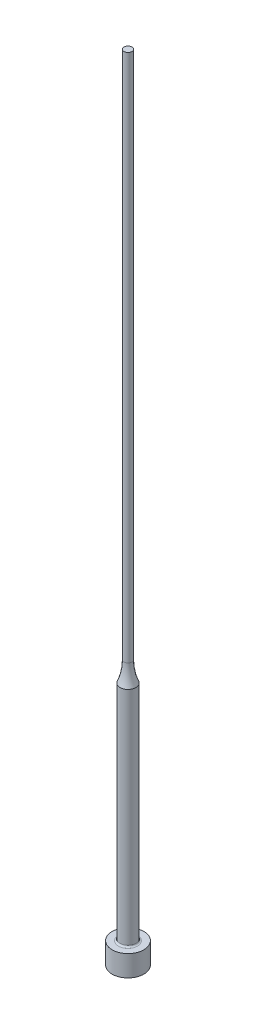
ISO-10303-21;
HEADER;
FILE_DESCRIPTION(('STEP AP214'),'2;1');
FILE_NAME('part.step','',(''),(''),'','','');
FILE_SCHEMA(('AUTOMOTIVE_DESIGN { 1 0 10303 214 1 1 1 1 }'));
ENDSEC;
DATA;
#1=APPLICATION_CONTEXT('core data for automotive mechanical design processes');
#2=APPLICATION_PROTOCOL_DEFINITION('international standard','automotive_design',2000,#1);
#3=PRODUCT_CONTEXT('',#1,'mechanical');
#4=PRODUCT('Part','Part','',(#3));
#5=PRODUCT_RELATED_PRODUCT_CATEGORY('part','',(#4));
#6=PRODUCT_DEFINITION_FORMATION('','',#4);
#7=PRODUCT_DEFINITION_CONTEXT('part definition',#1,'design');
#8=PRODUCT_DEFINITION('design','',#6,#7);
#9=PRODUCT_DEFINITION_SHAPE('','',#8);
#10=(LENGTH_UNIT() NAMED_UNIT(*) SI_UNIT(.MILLI.,.METRE.));
#11=(NAMED_UNIT(*) PLANE_ANGLE_UNIT() SI_UNIT($,.RADIAN.));
#12=(NAMED_UNIT(*) SI_UNIT($,.STERADIAN.) SOLID_ANGLE_UNIT());
#13=UNCERTAINTY_MEASURE_WITH_UNIT(LENGTH_MEASURE(1.E-05),#10,'distance_accuracy_value','');
#14=(GEOMETRIC_REPRESENTATION_CONTEXT(3) GLOBAL_UNCERTAINTY_ASSIGNED_CONTEXT((#13)) GLOBAL_UNIT_ASSIGNED_CONTEXT((#10,
#11,#12)) REPRESENTATION_CONTEXT('',''));
#15=CARTESIAN_POINT('',(0.,0.,0.));
#16=DIRECTION('',(0.,0.,1.));
#17=DIRECTION('',(1.,0.,0.));
#18=AXIS2_PLACEMENT_3D('',#15,#16,#17);
#19=CARTESIAN_POINT('',(0.750000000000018,150.,0.));
#20=DIRECTION('',(0.,-1.,0.));
#21=DIRECTION('',(1.,0.,0.));
#22=AXIS2_PLACEMENT_3D('',#19,#20,#21);
#23=PLANE('',#22);
#24=CARTESIAN_POINT('',(0.,150.,0.));
#25=DIRECTION('',(0.,1.,0.));
#26=DIRECTION('',(-1.,0.,0.));
#27=AXIS2_PLACEMENT_3D('',#24,#25,#26);
#28=CIRCLE('',#27,0.750000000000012);
#29=CARTESIAN_POINT('',(-0.750000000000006,150.,0.));
#30=VERTEX_POINT('',#29);
#31=EDGE_CURVE('E10',#30,#30,#28,.T.);
#32=ORIENTED_EDGE('',*,*,#31,.T.);
#33=EDGE_LOOP('',(#32));
#34=FACE_BOUND('',#33,.T.);
#35=ADVANCED_FACE('F30',(#34),#23,.F.);
#36=CARTESIAN_POINT('',(0.,150.,0.));
#37=DIRECTION('',(0.,1.,0.));
#38=DIRECTION('',(-1.,0.,0.));
#39=AXIS2_PLACEMENT_3D('',#36,#37,#38);
#40=CYLINDRICAL_SURFACE('',#39,0.750000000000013);
#41=ORIENTED_EDGE('',*,*,#31,.F.);
#42=EDGE_LOOP('',(#41));
#43=FACE_BOUND('',#42,.T.);
#44=CARTESIAN_POINT('',(0.,50.,0.));
#45=DIRECTION('',(0.,1.,0.));
#46=DIRECTION('',(-1.,0.,0.));
#47=AXIS2_PLACEMENT_3D('',#44,#45,#46);
#48=CIRCLE('',#47,0.750000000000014);
#49=CARTESIAN_POINT('',(-0.750000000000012,50.,0.));
#50=VERTEX_POINT('',#49);
#51=EDGE_CURVE('E36',#50,#50,#48,.T.);
#52=ORIENTED_EDGE('',*,*,#51,.T.);
#53=EDGE_LOOP('',(#52));
#54=FACE_BOUND('',#53,.T.);
#55=ADVANCED_FACE('F71',(#43,#54),#40,.T.);
#56=CARTESIAN_POINT('',(0.,50.,0.));
#57=DIRECTION('',(0.,1.,0.));
#58=DIRECTION('',(-1.,0.,0.));
#59=AXIS2_PLACEMENT_3D('',#56,#57,#58);
#60=TOROIDAL_SURFACE('',#59,10.75,10.);
#61=ORIENTED_EDGE('',*,*,#51,.F.);
#62=EDGE_LOOP('',(#61));
#63=FACE_BOUND('',#62,.T.);
#64=CARTESIAN_POINT('',(0.,46.2003289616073,0.));
#65=DIRECTION('',(0.,1.,0.));
#66=DIRECTION('',(-1.,0.,0.));
#67=AXIS2_PLACEMENT_3D('',#64,#65,#66);
#68=CIRCLE('',#67,1.50000000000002);
#69=CARTESIAN_POINT('',(-1.50000000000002,46.2003289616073,0.));
#70=VERTEX_POINT('',#69);
#71=EDGE_CURVE('E40',#70,#70,#68,.T.);
#72=ORIENTED_EDGE('',*,*,#71,.T.);
#73=EDGE_LOOP('',(#72));
#74=FACE_BOUND('',#73,.T.);
#75=ADVANCED_FACE('F75',(#63,#74),#60,.F.);
#76=CARTESIAN_POINT('',(0.,150.,0.));
#77=DIRECTION('',(0.,1.,0.));
#78=DIRECTION('',(-1.,0.,0.));
#79=AXIS2_PLACEMENT_3D('',#76,#77,#78);
#80=CYLINDRICAL_SURFACE('',#79,1.50000000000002);
#81=ORIENTED_EDGE('',*,*,#71,.F.);
#82=EDGE_LOOP('',(#81));
#83=FACE_BOUND('',#82,.T.);
#84=CARTESIAN_POINT('',(0.,4.3,0.));
#85=DIRECTION('',(0.,1.,0.));
#86=DIRECTION('',(-1.,0.,0.));
#87=AXIS2_PLACEMENT_3D('',#84,#85,#86);
#88=CIRCLE('',#87,1.50000000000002);
#89=CARTESIAN_POINT('',(-1.50000000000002,4.3,0.));
#90=VERTEX_POINT('',#89);
#91=EDGE_CURVE('E44',#90,#90,#88,.T.);
#92=ORIENTED_EDGE('',*,*,#91,.T.);
#93=EDGE_LOOP('',(#92));
#94=FACE_BOUND('',#93,.T.);
#95=ADVANCED_FACE('F80',(#83,#94),#80,.T.);
#96=CARTESIAN_POINT('',(0.,4.3,0.));
#97=DIRECTION('',(0.,1.,0.));
#98=DIRECTION('',(-1.,0.,0.));
#99=AXIS2_PLACEMENT_3D('',#96,#97,#98);
#100=TOROIDAL_SURFACE('',#99,1.80000000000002,0.3);
#101=ORIENTED_EDGE('',*,*,#91,.F.);
#102=EDGE_LOOP('',(#101));
#103=FACE_BOUND('',#102,.T.);
#104=CARTESIAN_POINT('',(0.,4.,0.));
#105=DIRECTION('',(0.,1.,0.));
#106=DIRECTION('',(-1.,0.,0.));
#107=AXIS2_PLACEMENT_3D('',#104,#105,#106);
#108=CIRCLE('',#107,1.80000000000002);
#109=CARTESIAN_POINT('',(-1.80000000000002,4.,0.));
#110=VERTEX_POINT('',#109);
#111=EDGE_CURVE('E49',#110,#110,#108,.T.);
#112=ORIENTED_EDGE('',*,*,#111,.T.);
#113=EDGE_LOOP('',(#112));
#114=FACE_BOUND('',#113,.T.);
#115=ADVANCED_FACE('F86',(#103,#114),#100,.F.);
#116=CARTESIAN_POINT('',(3.00000000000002,4.,0.));
#117=DIRECTION('',(0.,-1.,0.));
#118=DIRECTION('',(1.,0.,0.));
#119=AXIS2_PLACEMENT_3D('',#116,#117,#118);
#120=PLANE('',#119);
#121=ORIENTED_EDGE('',*,*,#111,.F.);
#122=EDGE_LOOP('',(#121));
#123=FACE_BOUND('',#122,.T.);
#124=CARTESIAN_POINT('',(0.,4.,0.));
#125=DIRECTION('',(0.,1.,0.));
#126=DIRECTION('',(-1.,0.,0.));
#127=AXIS2_PLACEMENT_3D('',#124,#125,#126);
#128=CIRCLE('',#127,3.00000000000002);
#129=CARTESIAN_POINT('',(-3.00000000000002,4.,0.));
#130=VERTEX_POINT('',#129);
#131=EDGE_CURVE('E52',#130,#130,#128,.T.);
#132=ORIENTED_EDGE('',*,*,#131,.T.);
#133=EDGE_LOOP('',(#132));
#134=FACE_BOUND('',#133,.T.);
#135=ADVANCED_FACE('F67',(#123,#134),#120,.F.);
#136=CARTESIAN_POINT('',(0.,150.,0.));
#137=DIRECTION('',(0.,1.,0.));
#138=DIRECTION('',(-1.,0.,0.));
#139=AXIS2_PLACEMENT_3D('',#136,#137,#138);
#140=CYLINDRICAL_SURFACE('',#139,3.00000000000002);
#141=ORIENTED_EDGE('',*,*,#131,.F.);
#142=EDGE_LOOP('',(#141));
#143=FACE_BOUND('',#142,.T.);
#144=CARTESIAN_POINT('',(0.,0.,0.));
#145=DIRECTION('',(0.,1.,0.));
#146=DIRECTION('',(-1.,0.,0.));
#147=AXIS2_PLACEMENT_3D('',#144,#145,#146);
#148=CIRCLE('',#147,3.00000000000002);
#149=CARTESIAN_POINT('',(-3.00000000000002,0.,0.));
#150=VERTEX_POINT('',#149);
#151=EDGE_CURVE('E55',#150,#150,#148,.T.);
#152=ORIENTED_EDGE('',*,*,#151,.T.);
#153=EDGE_LOOP('',(#152));
#154=FACE_BOUND('',#153,.T.);
#155=ADVANCED_FACE('F59',(#143,#154),#140,.T.);
#156=CARTESIAN_POINT('',(0.,0.,0.));
#157=DIRECTION('',(0.,1.,0.));
#158=DIRECTION('',(-1.,0.,0.));
#159=AXIS2_PLACEMENT_3D('',#156,#157,#158);
#160=PLANE('',#159);
#161=ORIENTED_EDGE('',*,*,#151,.F.);
#162=EDGE_LOOP('',(#161));
#163=FACE_BOUND('',#162,.T.);
#164=ADVANCED_FACE('F61',(#163),#160,.F.);
#165=CLOSED_SHELL('',(#35,#55,#75,#95,#115,#135,#155,#164));
#166=MANIFOLD_SOLID_BREP('B2',#165);
#167=ADVANCED_BREP_SHAPE_REPRESENTATION('',(#18,#166),#14);
#168=SHAPE_DEFINITION_REPRESENTATION(#9,#167);
ENDSEC;
END-ISO-10303-21;
